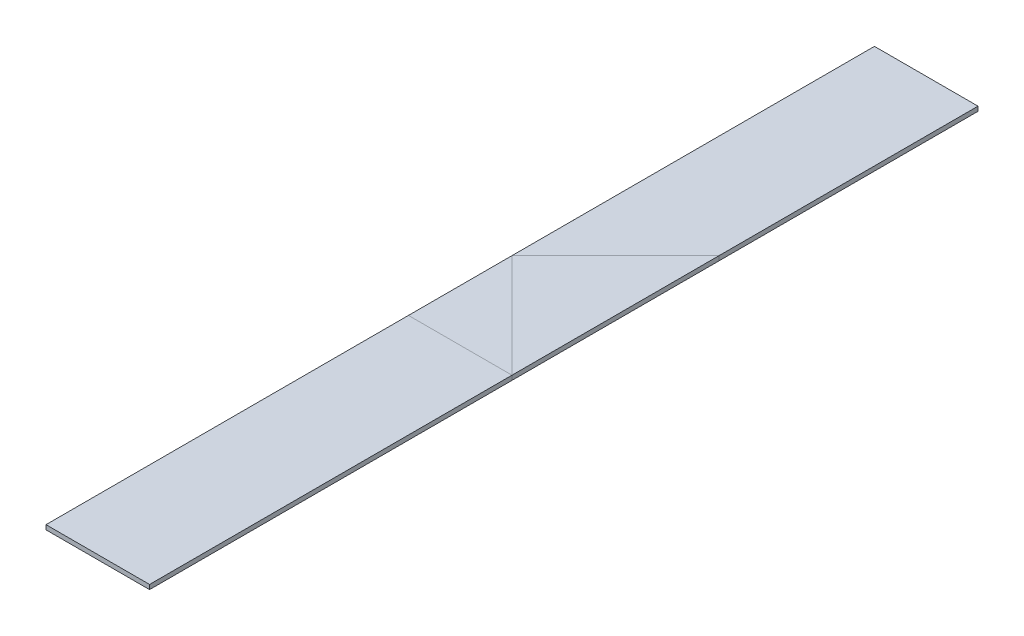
from build123d import *

# Parameters (mm, degrees)
BOSS_EXTRUDE2_DEPTH = 1
BOSS_EXTRUDE3_DEPTH = 1
BOSS_EXTRUDE5_DEPTH = 1
SKETCH1_7_W         = 23
SKETCH1_7_H         = 80.5
BOSS_EXTRUDE6_DEPTH = 1


with BuildPart() as part:
    # Sketch1 → Boss-Extrude2 (new body)
    with BuildSketch(Plane(origin=(0, 0, 0), x_dir=(1, 0, 0), z_dir=(0, 1, 0))):
        Polygon((0, 184), (0, 103.5), (23, 126.5), (23, 184), align=None)
    extrude(amount=BOSS_EXTRUDE2_DEPTH)


with BuildPart() as body_2:
    # Sketch1_4 → Boss-Extrude3 (new body)
    with BuildSketch(Plane(origin=(0, 0, 0), x_dir=(1, 0, 0), z_dir=(0, 1, 0))):
        Polygon((0, 103.5), (23, 80.5), (23, 126.5), align=None)
    extrude(amount=BOSS_EXTRUDE3_DEPTH)


with BuildPart() as body_3:
    # Sketch1_6 → Boss-Extrude5 (new body)
    with BuildSketch(Plane(origin=(0, 0, 0), x_dir=(1, 0, 0), z_dir=(0, 1, 0))):
        Polygon((0, 80.5), (23, 80.5), (0, 103.5), align=None)
    extrude(amount=BOSS_EXTRUDE5_DEPTH)


with BuildPart() as body_4:
    # Sketch1_7 → Boss-Extrude6 (new body)
    with BuildSketch(Plane(origin=(0, 0, 0), x_dir=(1, 0, 0), z_dir=(0, 1, 0))):
        with Locations((11.5, 40.25)):
            Rectangle(SKETCH1_7_W, SKETCH1_7_H)
    extrude(amount=BOSS_EXTRUDE6_DEPTH)


solid = Compound([part.part, body_2.part, body_3.part, body_4.part])
